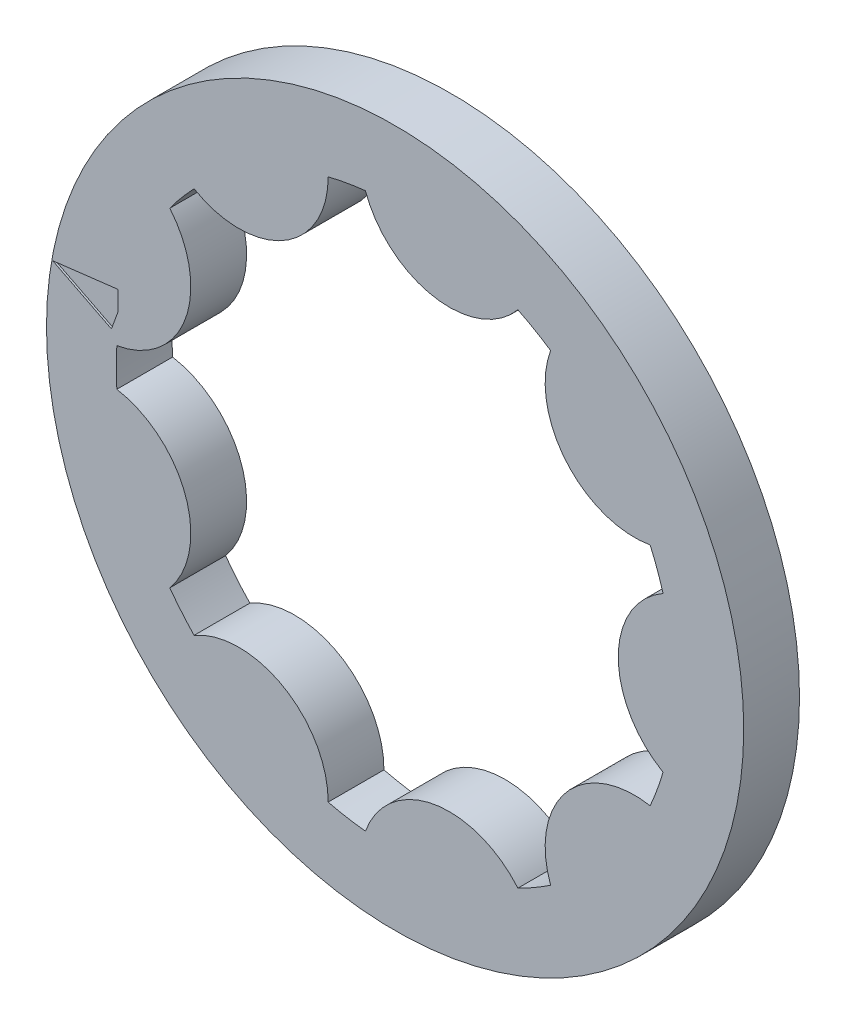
ISO-10303-21;
HEADER;
FILE_DESCRIPTION(('STEP AP214'),'2;1');
FILE_NAME('part.step','',(''),(''),'','','');
FILE_SCHEMA(('AUTOMOTIVE_DESIGN { 1 0 10303 214 1 1 1 1 }'));
ENDSEC;
DATA;
#1=APPLICATION_CONTEXT('core data for automotive mechanical design processes');
#2=APPLICATION_PROTOCOL_DEFINITION('international standard','automotive_design',2000,#1);
#3=PRODUCT_CONTEXT('',#1,'mechanical');
#4=PRODUCT('Part','Part','',(#3));
#5=PRODUCT_RELATED_PRODUCT_CATEGORY('part','',(#4));
#6=PRODUCT_DEFINITION_FORMATION('','',#4);
#7=PRODUCT_DEFINITION_CONTEXT('part definition',#1,'design');
#8=PRODUCT_DEFINITION('design','',#6,#7);
#9=PRODUCT_DEFINITION_SHAPE('','',#8);
#10=(LENGTH_UNIT() NAMED_UNIT(*) SI_UNIT(.MILLI.,.METRE.));
#11=(NAMED_UNIT(*) PLANE_ANGLE_UNIT() SI_UNIT($,.RADIAN.));
#12=(NAMED_UNIT(*) SI_UNIT($,.STERADIAN.) SOLID_ANGLE_UNIT());
#13=UNCERTAINTY_MEASURE_WITH_UNIT(LENGTH_MEASURE(1.E-05),#10,'distance_accuracy_value','');
#14=(GEOMETRIC_REPRESENTATION_CONTEXT(3) GLOBAL_UNCERTAINTY_ASSIGNED_CONTEXT((#13)) GLOBAL_UNIT_ASSIGNED_CONTEXT((#10,
#11,#12)) REPRESENTATION_CONTEXT('',''));
#15=CARTESIAN_POINT('',(0.,0.,0.));
#16=DIRECTION('',(0.,0.,1.));
#17=DIRECTION('',(1.,0.,0.));
#18=AXIS2_PLACEMENT_3D('',#15,#16,#17);
#19=CARTESIAN_POINT('',(0.,0.,3.));
#20=DIRECTION('',(0.,0.,1.));
#21=DIRECTION('',(1.,0.,0.));
#22=AXIS2_PLACEMENT_3D('',#19,#20,#21);
#23=PLANE('',#22);
#24=DIRECTION('',(0.892243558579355,-0.45155446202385,0.));
#25=VECTOR('',#24,1.);
#26=CARTESIAN_POINT('',(-18.4125710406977,3.24663305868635,3.));
#27=LINE('',#26,#25);
#28=CARTESIAN_POINT('',(-18.4125710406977,3.24663305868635,3.));
#29=VERTEX_POINT('',#28);
#30=CARTESIAN_POINT('',(-15.2568718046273,1.6495690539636,3.));
#31=VERTEX_POINT('',#30);
#32=EDGE_CURVE('E47',#29,#31,#27,.T.);
#33=ORIENTED_EDGE('',*,*,#32,.F.);
#34=DIRECTION('',(-0.992875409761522,-0.119157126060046,0.));
#35=VECTOR('',#34,1.);
#36=CARTESIAN_POINT('',(-18.4125710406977,3.24663305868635,3.));
#37=LINE('',#36,#35);
#38=CARTESIAN_POINT('',(-14.9009556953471,3.66806961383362,3.));
#39=VERTEX_POINT('',#38);
#40=EDGE_CURVE('E202',#39,#29,#37,.T.);
#41=ORIENTED_EDGE('',*,*,#40,.F.);
#42=DIRECTION('',(0.,1.,0.));
#43=VECTOR('',#42,1.);
#44=CARTESIAN_POINT('',(-14.9009556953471,3.66806961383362,3.));
#45=LINE('',#44,#43);
#46=CARTESIAN_POINT('',(-14.9009556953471,2.62744052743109,3.));
#47=VERTEX_POINT('',#46);
#48=EDGE_CURVE('E185',#47,#39,#45,.T.);
#49=ORIENTED_EDGE('',*,*,#48,.F.);
#50=DIRECTION('',(0.342020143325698,0.939692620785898,0.));
#51=VECTOR('',#50,1.);
#52=CARTESIAN_POINT('',(-15.2568718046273,1.6495690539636,3.));
#53=LINE('',#52,#51);
#54=EDGE_CURVE('E196',#31,#47,#53,.T.);
#55=ORIENTED_EDGE('',*,*,#54,.F.);
#56=EDGE_LOOP('',(#33,#41,#49,#55));
#57=FACE_BOUND('',#56,.T.);
#58=CARTESIAN_POINT('',(0.,0.,3.));
#59=DIRECTION('',(0.,0.,1.));
#60=DIRECTION('',(1.,0.,0.));
#61=AXIS2_PLACEMENT_3D('',#58,#59,#60);
#62=CIRCLE('',#61,18.75);
#63=CARTESIAN_POINT('',(18.75,0.,3.));
#64=VERTEX_POINT('',#63);
#65=EDGE_CURVE('E11',#64,#64,#62,.T.);
#66=ORIENTED_EDGE('',*,*,#65,.T.);
#67=EDGE_LOOP('',(#66));
#68=FACE_BOUND('',#67,.T.);
#69=CARTESIAN_POINT('',(2.9172893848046,16.5447702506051,3.));
#70=DIRECTION('',(0.,0.,-1.));
#71=DIRECTION('',(1.,0.,0.));
#72=AXIS2_PLACEMENT_3D('',#69,#70,#71);
#73=CIRCLE('',#72,4.8);
#74=CARTESIAN_POINT('',(6.6022370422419,13.4688702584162,3.));
#75=VERTEX_POINT('',#74);
#76=CARTESIAN_POINT('',(-1.59744849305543,14.9146960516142,3.));
#77=VERTEX_POINT('',#76);
#78=EDGE_CURVE('E278',#75,#77,#73,.T.);
#79=ORIENTED_EDGE('',*,*,#78,.F.);
#80=CARTESIAN_POINT('',(0.,0.,3.));
#81=DIRECTION('',(0.,0.,1.));
#82=DIRECTION('',(1.,0.,0.));
#83=AXIS2_PLACEMENT_3D('',#80,#81,#82);
#84=CIRCLE('',#83,15.);
#85=CARTESIAN_POINT('',(8.36326528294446,12.452140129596,3.));
#86=VERTEX_POINT('',#85);
#87=EDGE_CURVE('E276',#86,#75,#84,.T.);
#88=ORIENTED_EDGE('',*,*,#87,.F.);
#89=CARTESIAN_POINT('',(12.869546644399,10.7988318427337,3.));
#90=DIRECTION('',(0.,0.,-1.));
#91=DIRECTION('',(1.,0.,0.));
#92=AXIS2_PLACEMENT_3D('',#89,#90,#91);
#93=CIRCLE('',#92,4.8);
#94=CARTESIAN_POINT('',(13.7152299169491,6.07391704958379,3.));
#95=VERTEX_POINT('',#94);
#96=EDGE_CURVE('E274',#95,#86,#93,.T.);
#97=ORIENTED_EDGE('',*,*,#96,.F.);
#98=CARTESIAN_POINT('',(0.,0.,3.));
#99=DIRECTION('',(0.,0.,1.));
#100=DIRECTION('',(1.,0.,0.));
#101=AXIS2_PLACEMENT_3D('',#98,#99,#100);
#102=CIRCLE('',#101,15.);
#103=CARTESIAN_POINT('',(14.4107142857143,4.16308945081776,3.));
#104=VERTEX_POINT('',#103);
#105=EDGE_CURVE('E308',#104,#95,#102,.T.);
#106=ORIENTED_EDGE('',*,*,#105,.F.);
#107=CARTESIAN_POINT('',(16.8,0.,3.));
#108=DIRECTION('',(0.,0.,-1.));
#109=DIRECTION('',(1.,0.,0.));
#110=AXIS2_PLACEMENT_3D('',#107,#108,#109);
#111=CIRCLE('',#110,4.80000000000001);
#112=CARTESIAN_POINT('',(14.4107142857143,-4.16308945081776,3.));
#113=VERTEX_POINT('',#112);
#114=EDGE_CURVE('E306',#113,#104,#111,.T.);
#115=ORIENTED_EDGE('',*,*,#114,.F.);
#116=CARTESIAN_POINT('',(0.,0.,3.));
#117=DIRECTION('',(0.,0.,1.));
#118=DIRECTION('',(1.,0.,0.));
#119=AXIS2_PLACEMENT_3D('',#116,#117,#118);
#120=CIRCLE('',#119,15.);
#121=CARTESIAN_POINT('',(13.7152299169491,-6.07391704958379,3.));
#122=VERTEX_POINT('',#121);
#123=EDGE_CURVE('E304',#122,#113,#120,.T.);
#124=ORIENTED_EDGE('',*,*,#123,.F.);
#125=CARTESIAN_POINT('',(12.8695466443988,-10.7988318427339,3.));
#126=DIRECTION('',(0.,0.,-1.));
#127=DIRECTION('',(1.,0.,0.));
#128=AXIS2_PLACEMENT_3D('',#125,#126,#127);
#129=CIRCLE('',#128,4.8);
#130=CARTESIAN_POINT('',(8.36326528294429,-12.4521401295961,3.));
#131=VERTEX_POINT('',#130);
#132=EDGE_CURVE('E302',#131,#122,#129,.T.);
#133=ORIENTED_EDGE('',*,*,#132,.F.);
#134=CARTESIAN_POINT('',(0.,0.,3.));
#135=DIRECTION('',(0.,0.,1.));
#136=DIRECTION('',(1.,0.,0.));
#137=AXIS2_PLACEMENT_3D('',#134,#135,#136);
#138=CIRCLE('',#137,15.);
#139=CARTESIAN_POINT('',(6.60223704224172,-13.4688702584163,3.));
#140=VERTEX_POINT('',#139);
#141=EDGE_CURVE('E300',#140,#131,#138,.T.);
#142=ORIENTED_EDGE('',*,*,#141,.F.);
#143=CARTESIAN_POINT('',(2.91728938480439,-16.5447702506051,3.));
#144=DIRECTION('',(0.,0.,-1.));
#145=DIRECTION('',(1.,0.,0.));
#146=AXIS2_PLACEMENT_3D('',#143,#144,#145);
#147=CIRCLE('',#146,4.8);
#148=CARTESIAN_POINT('',(-1.59744849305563,-14.9146960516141,3.));
#149=VERTEX_POINT('',#148);
#150=EDGE_CURVE('E298',#149,#140,#147,.T.);
#151=ORIENTED_EDGE('',*,*,#150,.F.);
#152=CARTESIAN_POINT('',(0.,0.,3.));
#153=DIRECTION('',(0.,0.,1.));
#154=DIRECTION('',(1.,0.,0.));
#155=AXIS2_PLACEMENT_3D('',#152,#153,#154);
#156=CIRCLE('',#155,15.);
#157=CARTESIAN_POINT('',(-3.60001592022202,-14.5615893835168,3.));
#158=VERTEX_POINT('',#157);
#159=EDGE_CURVE('E296',#158,#149,#156,.T.);
#160=ORIENTED_EDGE('',*,*,#159,.F.);
#161=CARTESIAN_POINT('',(-8.40000000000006,-14.5492267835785,3.));
#162=DIRECTION('',(0.,0.,-1.));
#163=DIRECTION('',(1.,0.,0.));
#164=AXIS2_PLACEMENT_3D('',#161,#162,#163);
#165=CIRCLE('',#164,4.8);
#166=CARTESIAN_POINT('',(-10.8106983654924,-10.398499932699,3.));
#167=VERTEX_POINT('',#166);
#168=EDGE_CURVE('E294',#167,#158,#165,.T.);
#169=ORIENTED_EDGE('',*,*,#168,.F.);
#170=CARTESIAN_POINT('',(0.,0.,3.));
#171=DIRECTION('',(0.,0.,1.));
#172=DIRECTION('',(1.,0.,0.));
#173=AXIS2_PLACEMENT_3D('',#170,#171,#172);
#174=CIRCLE('',#173,15.);
#175=CARTESIAN_POINT('',(-12.1177814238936,-8.8407790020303,3.));
#176=VERTEX_POINT('',#175);
#177=EDGE_CURVE('E292',#176,#167,#174,.T.);
#178=ORIENTED_EDGE('',*,*,#177,.F.);
#179=CARTESIAN_POINT('',(-15.7868360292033,-5.74593840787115,3.));
#180=DIRECTION('',(0.,0.,-1.));
#181=DIRECTION('',(1.,0.,0.));
#182=AXIS2_PLACEMENT_3D('',#179,#180,#181);
#183=CIRCLE('',#182,4.8);
#184=CARTESIAN_POINT('',(-14.9655023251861,-1.01673012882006,3.));
#185=VERTEX_POINT('',#184);
#186=EDGE_CURVE('E290',#185,#176,#183,.T.);
#187=ORIENTED_EDGE('',*,*,#186,.F.);
#188=CARTESIAN_POINT('',(0.,0.,3.));
#189=DIRECTION('',(0.,0.,1.));
#190=DIRECTION('',(1.,0.,0.));
#191=AXIS2_PLACEMENT_3D('',#188,#189,#190);
#192=CIRCLE('',#191,15.);
#193=CARTESIAN_POINT('',(-14.9655023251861,1.01673012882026,3.));
#194=VERTEX_POINT('',#193);
#195=EDGE_CURVE('E288',#194,#185,#192,.T.);
#196=ORIENTED_EDGE('',*,*,#195,.F.);
#197=CARTESIAN_POINT('',(-15.7868360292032,5.74593840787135,3.));
#198=DIRECTION('',(0.,0.,-1.));
#199=DIRECTION('',(1.,0.,0.));
#200=AXIS2_PLACEMENT_3D('',#197,#198,#199);
#201=CIRCLE('',#200,4.8);
#202=CARTESIAN_POINT('',(-12.1177814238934,8.84077900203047,3.));
#203=VERTEX_POINT('',#202);
#204=EDGE_CURVE('E286',#203,#194,#201,.T.);
#205=ORIENTED_EDGE('',*,*,#204,.F.);
#206=CARTESIAN_POINT('',(0.,0.,3.));
#207=DIRECTION('',(0.,0.,1.));
#208=DIRECTION('',(1.,0.,0.));
#209=AXIS2_PLACEMENT_3D('',#206,#207,#208);
#210=CIRCLE('',#209,15.);
#211=CARTESIAN_POINT('',(-10.8106983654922,10.3984999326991,3.));
#212=VERTEX_POINT('',#211);
#213=EDGE_CURVE('E284',#212,#203,#210,.T.);
#214=ORIENTED_EDGE('',*,*,#213,.F.);
#215=CARTESIAN_POINT('',(-8.39999999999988,14.5492267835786,3.));
#216=DIRECTION('',(0.,0.,-1.));
#217=DIRECTION('',(1.,0.,0.));
#218=AXIS2_PLACEMENT_3D('',#215,#216,#217);
#219=CIRCLE('',#218,4.8);
#220=CARTESIAN_POINT('',(-3.60001592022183,14.5615893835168,3.));
#221=VERTEX_POINT('',#220);
#222=EDGE_CURVE('E282',#221,#212,#219,.T.);
#223=ORIENTED_EDGE('',*,*,#222,.F.);
#224=CARTESIAN_POINT('',(0.,0.,3.));
#225=DIRECTION('',(0.,0.,1.));
#226=DIRECTION('',(1.,0.,0.));
#227=AXIS2_PLACEMENT_3D('',#224,#225,#226);
#228=CIRCLE('',#227,15.);
#229=EDGE_CURVE('E280',#77,#221,#228,.T.);
#230=ORIENTED_EDGE('',*,*,#229,.F.);
#231=EDGE_LOOP('',(#79,#88,#97,#106,#115,#124,#133,#142,#151,#160,#169,#178,#187,#196,#205,#214,
#223,#230));
#232=FACE_BOUND('',#231,.T.);
#233=ADVANCED_FACE('F32',(#57,#68,#232),#23,.T.);
#234=CARTESIAN_POINT('',(0.,0.,0.));
#235=DIRECTION('',(0.,0.,1.));
#236=DIRECTION('',(1.,0.,0.));
#237=AXIS2_PLACEMENT_3D('',#234,#235,#236);
#238=PLANE('',#237);
#239=CARTESIAN_POINT('',(0.,0.,0.));
#240=DIRECTION('',(0.,0.,1.));
#241=DIRECTION('',(1.,0.,0.));
#242=AXIS2_PLACEMENT_3D('',#239,#240,#241);
#243=CIRCLE('',#242,18.75);
#244=CARTESIAN_POINT('',(18.75,0.,0.));
#245=VERTEX_POINT('',#244);
#246=EDGE_CURVE('E40',#245,#245,#243,.T.);
#247=ORIENTED_EDGE('',*,*,#246,.F.);
#248=EDGE_LOOP('',(#247));
#249=FACE_BOUND('',#248,.T.);
#250=CARTESIAN_POINT('',(0.,0.,0.));
#251=DIRECTION('',(0.,0.,1.));
#252=DIRECTION('',(1.,0.,0.));
#253=AXIS2_PLACEMENT_3D('',#250,#251,#252);
#254=CIRCLE('',#253,15.);
#255=CARTESIAN_POINT('',(8.36326528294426,12.4521401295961,0.));
#256=VERTEX_POINT('',#255);
#257=CARTESIAN_POINT('',(6.6022370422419,13.4688702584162,0.));
#258=VERTEX_POINT('',#257);
#259=EDGE_CURVE('E218',#256,#258,#254,.T.);
#260=ORIENTED_EDGE('',*,*,#259,.T.);
#261=CARTESIAN_POINT('',(2.9172893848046,16.5447702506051,0.));
#262=DIRECTION('',(0.,0.,-1.));
#263=DIRECTION('',(1.,0.,0.));
#264=AXIS2_PLACEMENT_3D('',#261,#262,#263);
#265=CIRCLE('',#264,4.8);
#266=CARTESIAN_POINT('',(-1.59744849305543,14.9146960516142,0.));
#267=VERTEX_POINT('',#266);
#268=EDGE_CURVE('E223',#258,#267,#265,.T.);
#269=ORIENTED_EDGE('',*,*,#268,.T.);
#270=CARTESIAN_POINT('',(0.,0.,0.));
#271=DIRECTION('',(0.,0.,1.));
#272=DIRECTION('',(1.,0.,0.));
#273=AXIS2_PLACEMENT_3D('',#270,#271,#272);
#274=CIRCLE('',#273,15.);
#275=CARTESIAN_POINT('',(-3.60001592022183,14.5615893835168,0.));
#276=VERTEX_POINT('',#275);
#277=EDGE_CURVE('E226',#267,#276,#274,.T.);
#278=ORIENTED_EDGE('',*,*,#277,.T.);
#279=CARTESIAN_POINT('',(-8.39999999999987,14.5492267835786,0.));
#280=DIRECTION('',(0.,0.,-1.));
#281=DIRECTION('',(1.,0.,0.));
#282=AXIS2_PLACEMENT_3D('',#279,#280,#281);
#283=CIRCLE('',#282,4.8);
#284=CARTESIAN_POINT('',(-10.8106983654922,10.3984999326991,0.));
#285=VERTEX_POINT('',#284);
#286=EDGE_CURVE('E229',#276,#285,#283,.T.);
#287=ORIENTED_EDGE('',*,*,#286,.T.);
#288=CARTESIAN_POINT('',(0.,0.,0.));
#289=DIRECTION('',(0.,0.,1.));
#290=DIRECTION('',(1.,0.,0.));
#291=AXIS2_PLACEMENT_3D('',#288,#289,#290);
#292=CIRCLE('',#291,15.);
#293=CARTESIAN_POINT('',(-12.1177814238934,8.84077900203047,0.));
#294=VERTEX_POINT('',#293);
#295=EDGE_CURVE('E232',#285,#294,#292,.T.);
#296=ORIENTED_EDGE('',*,*,#295,.T.);
#297=CARTESIAN_POINT('',(-15.7868360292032,5.74593840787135,0.));
#298=DIRECTION('',(0.,0.,-1.));
#299=DIRECTION('',(1.,0.,0.));
#300=AXIS2_PLACEMENT_3D('',#297,#298,#299);
#301=CIRCLE('',#300,4.8);
#302=CARTESIAN_POINT('',(-14.9655023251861,1.01673012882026,0.));
#303=VERTEX_POINT('',#302);
#304=EDGE_CURVE('E235',#294,#303,#301,.T.);
#305=ORIENTED_EDGE('',*,*,#304,.T.);
#306=CARTESIAN_POINT('',(0.,0.,0.));
#307=DIRECTION('',(0.,0.,1.));
#308=DIRECTION('',(1.,0.,0.));
#309=AXIS2_PLACEMENT_3D('',#306,#307,#308);
#310=CIRCLE('',#309,15.);
#311=CARTESIAN_POINT('',(-14.9655023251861,-1.01673012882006,0.));
#312=VERTEX_POINT('',#311);
#313=EDGE_CURVE('E238',#303,#312,#310,.T.);
#314=ORIENTED_EDGE('',*,*,#313,.T.);
#315=CARTESIAN_POINT('',(-15.7868360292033,-5.74593840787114,0.));
#316=DIRECTION('',(0.,0.,-1.));
#317=DIRECTION('',(1.,0.,0.));
#318=AXIS2_PLACEMENT_3D('',#315,#316,#317);
#319=CIRCLE('',#318,4.8);
#320=CARTESIAN_POINT('',(-12.1177814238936,-8.8407790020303,0.));
#321=VERTEX_POINT('',#320);
#322=EDGE_CURVE('E241',#312,#321,#319,.T.);
#323=ORIENTED_EDGE('',*,*,#322,.T.);
#324=CARTESIAN_POINT('',(0.,0.,0.));
#325=DIRECTION('',(0.,0.,1.));
#326=DIRECTION('',(1.,0.,0.));
#327=AXIS2_PLACEMENT_3D('',#324,#325,#326);
#328=CIRCLE('',#327,15.);
#329=CARTESIAN_POINT('',(-10.8106983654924,-10.398499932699,0.));
#330=VERTEX_POINT('',#329);
#331=EDGE_CURVE('E244',#321,#330,#328,.T.);
#332=ORIENTED_EDGE('',*,*,#331,.T.);
#333=CARTESIAN_POINT('',(-8.40000000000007,-14.5492267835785,0.));
#334=DIRECTION('',(0.,0.,-1.));
#335=DIRECTION('',(1.,0.,0.));
#336=AXIS2_PLACEMENT_3D('',#333,#334,#335);
#337=CIRCLE('',#336,4.8);
#338=CARTESIAN_POINT('',(-3.60001592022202,-14.5615893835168,0.));
#339=VERTEX_POINT('',#338);
#340=EDGE_CURVE('E247',#330,#339,#337,.T.);
#341=ORIENTED_EDGE('',*,*,#340,.T.);
#342=CARTESIAN_POINT('',(0.,0.,0.));
#343=DIRECTION('',(0.,0.,1.));
#344=DIRECTION('',(1.,0.,0.));
#345=AXIS2_PLACEMENT_3D('',#342,#343,#344);
#346=CIRCLE('',#345,15.);
#347=CARTESIAN_POINT('',(-1.59744849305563,-14.9146960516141,0.));
#348=VERTEX_POINT('',#347);
#349=EDGE_CURVE('E250',#339,#348,#346,.T.);
#350=ORIENTED_EDGE('',*,*,#349,.T.);
#351=CARTESIAN_POINT('',(2.91728938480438,-16.5447702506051,0.));
#352=DIRECTION('',(0.,0.,-1.));
#353=DIRECTION('',(1.,0.,0.));
#354=AXIS2_PLACEMENT_3D('',#351,#352,#353);
#355=CIRCLE('',#354,4.8);
#356=CARTESIAN_POINT('',(6.60223704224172,-13.4688702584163,0.));
#357=VERTEX_POINT('',#356);
#358=EDGE_CURVE('E253',#348,#357,#355,.T.);
#359=ORIENTED_EDGE('',*,*,#358,.T.);
#360=CARTESIAN_POINT('',(0.,0.,0.));
#361=DIRECTION('',(0.,0.,1.));
#362=DIRECTION('',(1.,0.,0.));
#363=AXIS2_PLACEMENT_3D('',#360,#361,#362);
#364=CIRCLE('',#363,15.);
#365=CARTESIAN_POINT('',(8.36326528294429,-12.4521401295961,0.));
#366=VERTEX_POINT('',#365);
#367=EDGE_CURVE('E256',#357,#366,#364,.T.);
#368=ORIENTED_EDGE('',*,*,#367,.T.);
#369=CARTESIAN_POINT('',(12.8695466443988,-10.7988318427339,0.));
#370=DIRECTION('',(0.,0.,-1.));
#371=DIRECTION('',(1.,0.,0.));
#372=AXIS2_PLACEMENT_3D('',#369,#370,#371);
#373=CIRCLE('',#372,4.8);
#374=CARTESIAN_POINT('',(13.7152299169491,-6.07391704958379,0.));
#375=VERTEX_POINT('',#374);
#376=EDGE_CURVE('E259',#366,#375,#373,.T.);
#377=ORIENTED_EDGE('',*,*,#376,.T.);
#378=CARTESIAN_POINT('',(0.,0.,0.));
#379=DIRECTION('',(0.,0.,1.));
#380=DIRECTION('',(1.,0.,0.));
#381=AXIS2_PLACEMENT_3D('',#378,#379,#380);
#382=CIRCLE('',#381,15.);
#383=CARTESIAN_POINT('',(14.4107142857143,-4.16308945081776,0.));
#384=VERTEX_POINT('',#383);
#385=EDGE_CURVE('E262',#375,#384,#382,.T.);
#386=ORIENTED_EDGE('',*,*,#385,.T.);
#387=CARTESIAN_POINT('',(16.8,0.,0.));
#388=DIRECTION('',(0.,0.,-1.));
#389=DIRECTION('',(1.,0.,0.));
#390=AXIS2_PLACEMENT_3D('',#387,#388,#389);
#391=CIRCLE('',#390,4.8);
#392=CARTESIAN_POINT('',(14.4107142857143,4.16308945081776,0.));
#393=VERTEX_POINT('',#392);
#394=EDGE_CURVE('E265',#384,#393,#391,.T.);
#395=ORIENTED_EDGE('',*,*,#394,.T.);
#396=CARTESIAN_POINT('',(0.,0.,0.));
#397=DIRECTION('',(0.,0.,1.));
#398=DIRECTION('',(1.,0.,0.));
#399=AXIS2_PLACEMENT_3D('',#396,#397,#398);
#400=CIRCLE('',#399,15.);
#401=CARTESIAN_POINT('',(13.7152299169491,6.07391704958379,0.));
#402=VERTEX_POINT('',#401);
#403=EDGE_CURVE('E268',#393,#402,#400,.T.);
#404=ORIENTED_EDGE('',*,*,#403,.T.);
#405=CARTESIAN_POINT('',(12.8695466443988,10.7988318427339,0.));
#406=DIRECTION('',(0.,0.,-1.));
#407=DIRECTION('',(1.,0.,0.));
#408=AXIS2_PLACEMENT_3D('',#405,#406,#407);
#409=CIRCLE('',#408,4.8);
#410=EDGE_CURVE('E271',#402,#256,#409,.T.);
#411=ORIENTED_EDGE('',*,*,#410,.T.);
#412=EDGE_LOOP('',(#260,#269,#278,#287,#296,#305,#314,#323,#332,#341,#350,#359,#368,#377,#386,
#395,#404,#411));
#413=FACE_BOUND('',#412,.T.);
#414=ADVANCED_FACE('F356',(#249,#413),#238,.F.);
#415=CARTESIAN_POINT('',(0.,0.,3.));
#416=DIRECTION('',(0.,0.,-1.));
#417=DIRECTION('',(-1.,0.,0.));
#418=AXIS2_PLACEMENT_3D('',#415,#416,#417);
#419=CYLINDRICAL_SURFACE('',#418,18.75);
#420=ORIENTED_EDGE('',*,*,#65,.F.);
#421=EDGE_LOOP('',(#420));
#422=FACE_BOUND('',#421,.T.);
#423=ORIENTED_EDGE('',*,*,#246,.T.);
#424=EDGE_LOOP('',(#423));
#425=FACE_BOUND('',#424,.T.);
#426=ADVANCED_FACE('F34',(#422,#425),#419,.T.);
#427=CARTESIAN_POINT('',(0.,0.,3.));
#428=DIRECTION('',(0.,0.,-1.));
#429=DIRECTION('',(-1.,0.,0.));
#430=AXIS2_PLACEMENT_3D('',#427,#428,#429);
#431=CYLINDRICAL_SURFACE('',#430,15.);
#432=ORIENTED_EDGE('',*,*,#259,.F.);
#433=DIRECTION('',(0.,0.,-1.));
#434=VECTOR('',#433,1.);
#435=CARTESIAN_POINT('',(8.36326528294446,12.452140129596,3.));
#436=LINE('',#435,#434);
#437=EDGE_CURVE('E351',#86,#256,#436,.T.);
#438=ORIENTED_EDGE('',*,*,#437,.F.);
#439=ORIENTED_EDGE('',*,*,#87,.T.);
#440=DIRECTION('',(0.,0.,-1.));
#441=VECTOR('',#440,1.);
#442=CARTESIAN_POINT('',(6.6022370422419,13.4688702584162,3.));
#443=LINE('',#442,#441);
#444=EDGE_CURVE('E348',#75,#258,#443,.T.);
#445=ORIENTED_EDGE('',*,*,#444,.T.);
#446=EDGE_LOOP('',(#432,#438,#439,#445));
#447=FACE_BOUND('',#446,.T.);
#448=ADVANCED_FACE('F363',(#447),#431,.F.);
#449=CARTESIAN_POINT('',(2.9172893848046,16.5447702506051,3.));
#450=DIRECTION('',(0.,0.,-1.));
#451=DIRECTION('',(-1.,0.,0.));
#452=AXIS2_PLACEMENT_3D('',#449,#450,#451);
#453=CYLINDRICAL_SURFACE('',#452,4.8);
#454=ORIENTED_EDGE('',*,*,#268,.F.);
#455=ORIENTED_EDGE('',*,*,#444,.F.);
#456=ORIENTED_EDGE('',*,*,#78,.T.);
#457=DIRECTION('',(0.,0.,-1.));
#458=VECTOR('',#457,1.);
#459=CARTESIAN_POINT('',(-1.59744849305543,14.9146960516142,3.));
#460=LINE('',#459,#458);
#461=EDGE_CURVE('E346',#77,#267,#460,.T.);
#462=ORIENTED_EDGE('',*,*,#461,.T.);
#463=EDGE_LOOP('',(#454,#455,#456,#462));
#464=FACE_BOUND('',#463,.T.);
#465=ADVANCED_FACE('F368',(#464),#453,.T.);
#466=CARTESIAN_POINT('',(0.,0.,3.));
#467=DIRECTION('',(0.,0.,-1.));
#468=DIRECTION('',(-1.,0.,0.));
#469=AXIS2_PLACEMENT_3D('',#466,#467,#468);
#470=CYLINDRICAL_SURFACE('',#469,15.);
#471=ORIENTED_EDGE('',*,*,#277,.F.);
#472=ORIENTED_EDGE('',*,*,#461,.F.);
#473=ORIENTED_EDGE('',*,*,#229,.T.);
#474=DIRECTION('',(0.,0.,-1.));
#475=VECTOR('',#474,1.);
#476=CARTESIAN_POINT('',(-3.60001592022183,14.5615893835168,3.));
#477=LINE('',#476,#475);
#478=EDGE_CURVE('E343',#221,#276,#477,.T.);
#479=ORIENTED_EDGE('',*,*,#478,.T.);
#480=EDGE_LOOP('',(#471,#472,#473,#479));
#481=FACE_BOUND('',#480,.T.);
#482=ADVANCED_FACE('F378',(#481),#470,.F.);
#483=CARTESIAN_POINT('',(-8.39999999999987,14.5492267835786,3.));
#484=DIRECTION('',(0.,0.,-1.));
#485=DIRECTION('',(-1.,0.,0.));
#486=AXIS2_PLACEMENT_3D('',#483,#484,#485);
#487=CYLINDRICAL_SURFACE('',#486,4.8);
#488=ORIENTED_EDGE('',*,*,#286,.F.);
#489=ORIENTED_EDGE('',*,*,#478,.F.);
#490=ORIENTED_EDGE('',*,*,#222,.T.);
#491=DIRECTION('',(0.,0.,-1.));
#492=VECTOR('',#491,1.);
#493=CARTESIAN_POINT('',(-10.8106983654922,10.3984999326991,3.));
#494=LINE('',#493,#492);
#495=EDGE_CURVE('E341',#212,#285,#494,.T.);
#496=ORIENTED_EDGE('',*,*,#495,.T.);
#497=EDGE_LOOP('',(#488,#489,#490,#496));
#498=FACE_BOUND('',#497,.T.);
#499=ADVANCED_FACE('F380',(#498),#487,.T.);
#500=CARTESIAN_POINT('',(0.,0.,3.));
#501=DIRECTION('',(0.,0.,-1.));
#502=DIRECTION('',(-1.,0.,0.));
#503=AXIS2_PLACEMENT_3D('',#500,#501,#502);
#504=CYLINDRICAL_SURFACE('',#503,15.);
#505=ORIENTED_EDGE('',*,*,#295,.F.);
#506=ORIENTED_EDGE('',*,*,#495,.F.);
#507=ORIENTED_EDGE('',*,*,#213,.T.);
#508=DIRECTION('',(0.,0.,-1.));
#509=VECTOR('',#508,1.);
#510=CARTESIAN_POINT('',(-12.1177814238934,8.84077900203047,3.));
#511=LINE('',#510,#509);
#512=EDGE_CURVE('E338',#203,#294,#511,.T.);
#513=ORIENTED_EDGE('',*,*,#512,.T.);
#514=EDGE_LOOP('',(#505,#506,#507,#513));
#515=FACE_BOUND('',#514,.T.);
#516=ADVANCED_FACE('F384',(#515),#504,.F.);
#517=CARTESIAN_POINT('',(-15.7868360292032,5.74593840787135,3.));
#518=DIRECTION('',(0.,0.,-1.));
#519=DIRECTION('',(-1.,0.,0.));
#520=AXIS2_PLACEMENT_3D('',#517,#518,#519);
#521=CYLINDRICAL_SURFACE('',#520,4.8);
#522=ORIENTED_EDGE('',*,*,#304,.F.);
#523=ORIENTED_EDGE('',*,*,#512,.F.);
#524=ORIENTED_EDGE('',*,*,#204,.T.);
#525=DIRECTION('',(0.,0.,-1.));
#526=VECTOR('',#525,1.);
#527=CARTESIAN_POINT('',(-14.9655023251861,1.01673012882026,3.));
#528=LINE('',#527,#526);
#529=EDGE_CURVE('E336',#194,#303,#528,.T.);
#530=ORIENTED_EDGE('',*,*,#529,.T.);
#531=EDGE_LOOP('',(#522,#523,#524,#530));
#532=FACE_BOUND('',#531,.T.);
#533=ADVANCED_FACE('F388',(#532),#521,.T.);
#534=CARTESIAN_POINT('',(0.,0.,3.));
#535=DIRECTION('',(0.,0.,-1.));
#536=DIRECTION('',(-1.,0.,0.));
#537=AXIS2_PLACEMENT_3D('',#534,#535,#536);
#538=CYLINDRICAL_SURFACE('',#537,15.);
#539=ORIENTED_EDGE('',*,*,#313,.F.);
#540=ORIENTED_EDGE('',*,*,#529,.F.);
#541=ORIENTED_EDGE('',*,*,#195,.T.);
#542=DIRECTION('',(0.,0.,-1.));
#543=VECTOR('',#542,1.);
#544=CARTESIAN_POINT('',(-14.9655023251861,-1.01673012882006,3.));
#545=LINE('',#544,#543);
#546=EDGE_CURVE('E333',#185,#312,#545,.T.);
#547=ORIENTED_EDGE('',*,*,#546,.T.);
#548=EDGE_LOOP('',(#539,#540,#541,#547));
#549=FACE_BOUND('',#548,.T.);
#550=ADVANCED_FACE('F396',(#549),#538,.F.);
#551=CARTESIAN_POINT('',(-15.7868360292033,-5.74593840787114,3.));
#552=DIRECTION('',(0.,0.,-1.));
#553=DIRECTION('',(-1.,0.,0.));
#554=AXIS2_PLACEMENT_3D('',#551,#552,#553);
#555=CYLINDRICAL_SURFACE('',#554,4.8);
#556=ORIENTED_EDGE('',*,*,#322,.F.);
#557=ORIENTED_EDGE('',*,*,#546,.F.);
#558=ORIENTED_EDGE('',*,*,#186,.T.);
#559=DIRECTION('',(0.,0.,-1.));
#560=VECTOR('',#559,1.);
#561=CARTESIAN_POINT('',(-12.1177814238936,-8.8407790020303,3.));
#562=LINE('',#561,#560);
#563=EDGE_CURVE('E331',#176,#321,#562,.T.);
#564=ORIENTED_EDGE('',*,*,#563,.T.);
#565=EDGE_LOOP('',(#556,#557,#558,#564));
#566=FACE_BOUND('',#565,.T.);
#567=ADVANCED_FACE('F398',(#566),#555,.T.);
#568=CARTESIAN_POINT('',(0.,0.,3.));
#569=DIRECTION('',(0.,0.,-1.));
#570=DIRECTION('',(-1.,0.,0.));
#571=AXIS2_PLACEMENT_3D('',#568,#569,#570);
#572=CYLINDRICAL_SURFACE('',#571,15.);
#573=ORIENTED_EDGE('',*,*,#331,.F.);
#574=ORIENTED_EDGE('',*,*,#563,.F.);
#575=ORIENTED_EDGE('',*,*,#177,.T.);
#576=DIRECTION('',(0.,0.,-1.));
#577=VECTOR('',#576,1.);
#578=CARTESIAN_POINT('',(-10.8106983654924,-10.398499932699,3.));
#579=LINE('',#578,#577);
#580=EDGE_CURVE('E328',#167,#330,#579,.T.);
#581=ORIENTED_EDGE('',*,*,#580,.T.);
#582=EDGE_LOOP('',(#573,#574,#575,#581));
#583=FACE_BOUND('',#582,.T.);
#584=ADVANCED_FACE('F402',(#583),#572,.F.);
#585=CARTESIAN_POINT('',(-8.40000000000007,-14.5492267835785,3.));
#586=DIRECTION('',(0.,0.,-1.));
#587=DIRECTION('',(-1.,0.,0.));
#588=AXIS2_PLACEMENT_3D('',#585,#586,#587);
#589=CYLINDRICAL_SURFACE('',#588,4.8);
#590=ORIENTED_EDGE('',*,*,#340,.F.);
#591=ORIENTED_EDGE('',*,*,#580,.F.);
#592=ORIENTED_EDGE('',*,*,#168,.T.);
#593=DIRECTION('',(0.,0.,-1.));
#594=VECTOR('',#593,1.);
#595=CARTESIAN_POINT('',(-3.60001592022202,-14.5615893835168,3.));
#596=LINE('',#595,#594);
#597=EDGE_CURVE('E326',#158,#339,#596,.T.);
#598=ORIENTED_EDGE('',*,*,#597,.T.);
#599=EDGE_LOOP('',(#590,#591,#592,#598));
#600=FACE_BOUND('',#599,.T.);
#601=ADVANCED_FACE('F406',(#600),#589,.T.);
#602=CARTESIAN_POINT('',(0.,0.,3.));
#603=DIRECTION('',(0.,0.,-1.));
#604=DIRECTION('',(-1.,0.,0.));
#605=AXIS2_PLACEMENT_3D('',#602,#603,#604);
#606=CYLINDRICAL_SURFACE('',#605,15.);
#607=ORIENTED_EDGE('',*,*,#349,.F.);
#608=ORIENTED_EDGE('',*,*,#597,.F.);
#609=ORIENTED_EDGE('',*,*,#159,.T.);
#610=DIRECTION('',(0.,0.,-1.));
#611=VECTOR('',#610,1.);
#612=CARTESIAN_POINT('',(-1.59744849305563,-14.9146960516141,3.));
#613=LINE('',#612,#611);
#614=EDGE_CURVE('E323',#149,#348,#613,.T.);
#615=ORIENTED_EDGE('',*,*,#614,.T.);
#616=EDGE_LOOP('',(#607,#608,#609,#615));
#617=FACE_BOUND('',#616,.T.);
#618=ADVANCED_FACE('F414',(#617),#606,.F.);
#619=CARTESIAN_POINT('',(2.91728938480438,-16.5447702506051,3.));
#620=DIRECTION('',(0.,0.,-1.));
#621=DIRECTION('',(-1.,0.,0.));
#622=AXIS2_PLACEMENT_3D('',#619,#620,#621);
#623=CYLINDRICAL_SURFACE('',#622,4.8);
#624=ORIENTED_EDGE('',*,*,#358,.F.);
#625=ORIENTED_EDGE('',*,*,#614,.F.);
#626=ORIENTED_EDGE('',*,*,#150,.T.);
#627=DIRECTION('',(0.,0.,-1.));
#628=VECTOR('',#627,1.);
#629=CARTESIAN_POINT('',(6.60223704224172,-13.4688702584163,3.));
#630=LINE('',#629,#628);
#631=EDGE_CURVE('E321',#140,#357,#630,.T.);
#632=ORIENTED_EDGE('',*,*,#631,.T.);
#633=EDGE_LOOP('',(#624,#625,#626,#632));
#634=FACE_BOUND('',#633,.T.);
#635=ADVANCED_FACE('F416',(#634),#623,.T.);
#636=CARTESIAN_POINT('',(0.,0.,3.));
#637=DIRECTION('',(0.,0.,-1.));
#638=DIRECTION('',(-1.,0.,0.));
#639=AXIS2_PLACEMENT_3D('',#636,#637,#638);
#640=CYLINDRICAL_SURFACE('',#639,15.);
#641=ORIENTED_EDGE('',*,*,#367,.F.);
#642=ORIENTED_EDGE('',*,*,#631,.F.);
#643=ORIENTED_EDGE('',*,*,#141,.T.);
#644=DIRECTION('',(0.,0.,-1.));
#645=VECTOR('',#644,1.);
#646=CARTESIAN_POINT('',(8.36326528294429,-12.4521401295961,3.));
#647=LINE('',#646,#645);
#648=EDGE_CURVE('E318',#131,#366,#647,.T.);
#649=ORIENTED_EDGE('',*,*,#648,.T.);
#650=EDGE_LOOP('',(#641,#642,#643,#649));
#651=FACE_BOUND('',#650,.T.);
#652=ADVANCED_FACE('F420',(#651),#640,.F.);
#653=CARTESIAN_POINT('',(12.8695466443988,-10.7988318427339,3.));
#654=DIRECTION('',(0.,0.,-1.));
#655=DIRECTION('',(-1.,0.,0.));
#656=AXIS2_PLACEMENT_3D('',#653,#654,#655);
#657=CYLINDRICAL_SURFACE('',#656,4.8);
#658=ORIENTED_EDGE('',*,*,#376,.F.);
#659=ORIENTED_EDGE('',*,*,#648,.F.);
#660=ORIENTED_EDGE('',*,*,#132,.T.);
#661=DIRECTION('',(0.,0.,-1.));
#662=VECTOR('',#661,1.);
#663=CARTESIAN_POINT('',(13.7152299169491,-6.07391704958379,3.));
#664=LINE('',#663,#662);
#665=EDGE_CURVE('E316',#122,#375,#664,.T.);
#666=ORIENTED_EDGE('',*,*,#665,.T.);
#667=EDGE_LOOP('',(#658,#659,#660,#666));
#668=FACE_BOUND('',#667,.T.);
#669=ADVANCED_FACE('F424',(#668),#657,.T.);
#670=CARTESIAN_POINT('',(0.,0.,3.));
#671=DIRECTION('',(0.,0.,-1.));
#672=DIRECTION('',(-1.,0.,0.));
#673=AXIS2_PLACEMENT_3D('',#670,#671,#672);
#674=CYLINDRICAL_SURFACE('',#673,15.);
#675=ORIENTED_EDGE('',*,*,#385,.F.);
#676=ORIENTED_EDGE('',*,*,#665,.F.);
#677=ORIENTED_EDGE('',*,*,#123,.T.);
#678=DIRECTION('',(0.,0.,-1.));
#679=VECTOR('',#678,1.);
#680=CARTESIAN_POINT('',(14.4107142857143,-4.16308945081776,3.));
#681=LINE('',#680,#679);
#682=EDGE_CURVE('E313',#113,#384,#681,.T.);
#683=ORIENTED_EDGE('',*,*,#682,.T.);
#684=EDGE_LOOP('',(#675,#676,#677,#683));
#685=FACE_BOUND('',#684,.T.);
#686=ADVANCED_FACE('F432',(#685),#674,.F.);
#687=CARTESIAN_POINT('',(16.8,0.,3.));
#688=DIRECTION('',(0.,0.,-1.));
#689=DIRECTION('',(-1.,0.,0.));
#690=AXIS2_PLACEMENT_3D('',#687,#688,#689);
#691=CYLINDRICAL_SURFACE('',#690,4.8);
#692=ORIENTED_EDGE('',*,*,#394,.F.);
#693=ORIENTED_EDGE('',*,*,#682,.F.);
#694=ORIENTED_EDGE('',*,*,#114,.T.);
#695=DIRECTION('',(0.,0.,-1.));
#696=VECTOR('',#695,1.);
#697=CARTESIAN_POINT('',(14.4107142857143,4.16308945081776,3.));
#698=LINE('',#697,#696);
#699=EDGE_CURVE('E311',#104,#393,#698,.T.);
#700=ORIENTED_EDGE('',*,*,#699,.T.);
#701=EDGE_LOOP('',(#692,#693,#694,#700));
#702=FACE_BOUND('',#701,.T.);
#703=ADVANCED_FACE('F434',(#702),#691,.T.);
#704=CARTESIAN_POINT('',(0.,0.,3.));
#705=DIRECTION('',(0.,0.,-1.));
#706=DIRECTION('',(-1.,0.,0.));
#707=AXIS2_PLACEMENT_3D('',#704,#705,#706);
#708=CYLINDRICAL_SURFACE('',#707,15.);
#709=ORIENTED_EDGE('',*,*,#403,.F.);
#710=ORIENTED_EDGE('',*,*,#699,.F.);
#711=ORIENTED_EDGE('',*,*,#105,.T.);
#712=DIRECTION('',(0.,0.,-1.));
#713=VECTOR('',#712,1.);
#714=CARTESIAN_POINT('',(13.7152299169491,6.07391704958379,3.));
#715=LINE('',#714,#713);
#716=EDGE_CURVE('E55',#95,#402,#715,.T.);
#717=ORIENTED_EDGE('',*,*,#716,.T.);
#718=EDGE_LOOP('',(#709,#710,#711,#717));
#719=FACE_BOUND('',#718,.T.);
#720=ADVANCED_FACE('F438',(#719),#708,.F.);
#721=CARTESIAN_POINT('',(12.8695466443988,10.7988318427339,3.));
#722=DIRECTION('',(0.,0.,-1.));
#723=DIRECTION('',(-1.,0.,0.));
#724=AXIS2_PLACEMENT_3D('',#721,#722,#723);
#725=CYLINDRICAL_SURFACE('',#724,4.8);
#726=ORIENTED_EDGE('',*,*,#410,.F.);
#727=ORIENTED_EDGE('',*,*,#716,.F.);
#728=ORIENTED_EDGE('',*,*,#96,.T.);
#729=ORIENTED_EDGE('',*,*,#437,.T.);
#730=EDGE_LOOP('',(#726,#727,#728,#729));
#731=FACE_BOUND('',#730,.T.);
#732=ADVANCED_FACE('F439',(#731),#725,.T.);
#733=CARTESIAN_POINT('',(-18.4125710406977,3.24663305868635,2.9));
#734=DIRECTION('',(-0.45155446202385,-0.892243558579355,0.));
#735=DIRECTION('',(0.892243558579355,-0.45155446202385,0.));
#736=AXIS2_PLACEMENT_3D('',#733,#734,#735);
#737=PLANE('',#736);
#738=ORIENTED_EDGE('',*,*,#32,.T.);
#739=DIRECTION('',(0.,0.,1.));
#740=VECTOR('',#739,1.);
#741=CARTESIAN_POINT('',(-15.2568718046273,1.6495690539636,2.9));
#742=LINE('',#741,#740);
#743=CARTESIAN_POINT('',(-15.2568718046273,1.6495690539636,2.9));
#744=VERTEX_POINT('',#743);
#745=EDGE_CURVE('E193',#744,#31,#742,.T.);
#746=ORIENTED_EDGE('',*,*,#745,.F.);
#747=DIRECTION('',(0.892243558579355,-0.45155446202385,0.));
#748=VECTOR('',#747,1.);
#749=CARTESIAN_POINT('',(-18.4125710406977,3.24663305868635,2.9));
#750=LINE('',#749,#748);
#751=CARTESIAN_POINT('',(-18.4125710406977,3.24663305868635,2.9));
#752=VERTEX_POINT('',#751);
#753=EDGE_CURVE('E204',#752,#744,#750,.T.);
#754=ORIENTED_EDGE('',*,*,#753,.F.);
#755=DIRECTION('',(0.,0.,1.));
#756=VECTOR('',#755,1.);
#757=CARTESIAN_POINT('',(-18.4125710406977,3.24663305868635,2.9));
#758=LINE('',#757,#756);
#759=EDGE_CURVE('E216',#752,#29,#758,.T.);
#760=ORIENTED_EDGE('',*,*,#759,.T.);
#761=EDGE_LOOP('',(#738,#746,#754,#760));
#762=FACE_BOUND('',#761,.T.);
#763=ADVANCED_FACE('F441',(#762),#737,.F.);
#764=CARTESIAN_POINT('',(-18.4125710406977,3.24663305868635,2.9));
#765=DIRECTION('',(-0.119157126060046,0.992875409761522,0.));
#766=DIRECTION('',(-0.992875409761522,-0.119157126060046,0.));
#767=AXIS2_PLACEMENT_3D('',#764,#765,#766);
#768=PLANE('',#767);
#769=ORIENTED_EDGE('',*,*,#40,.T.);
#770=ORIENTED_EDGE('',*,*,#759,.F.);
#771=DIRECTION('',(-0.992875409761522,-0.119157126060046,0.));
#772=VECTOR('',#771,1.);
#773=CARTESIAN_POINT('',(-18.4125710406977,3.24663305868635,2.9));
#774=LINE('',#773,#772);
#775=CARTESIAN_POINT('',(-14.9009556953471,3.66806961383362,2.9));
#776=VERTEX_POINT('',#775);
#777=EDGE_CURVE('E213',#776,#752,#774,.T.);
#778=ORIENTED_EDGE('',*,*,#777,.F.);
#779=DIRECTION('',(0.,0.,1.));
#780=VECTOR('',#779,1.);
#781=CARTESIAN_POINT('',(-14.9009556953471,3.66806961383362,2.9));
#782=LINE('',#781,#780);
#783=EDGE_CURVE('E192',#776,#39,#782,.T.);
#784=ORIENTED_EDGE('',*,*,#783,.T.);
#785=EDGE_LOOP('',(#769,#770,#778,#784));
#786=FACE_BOUND('',#785,.T.);
#787=ADVANCED_FACE('F447',(#786),#768,.F.);
#788=CARTESIAN_POINT('',(-14.9009556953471,3.66806961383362,2.9));
#789=DIRECTION('',(1.,0.,0.));
#790=DIRECTION('',(0.,1.,0.));
#791=AXIS2_PLACEMENT_3D('',#788,#789,#790);
#792=PLANE('',#791);
#793=ORIENTED_EDGE('',*,*,#48,.T.);
#794=ORIENTED_EDGE('',*,*,#783,.F.);
#795=DIRECTION('',(0.,1.,0.));
#796=VECTOR('',#795,1.);
#797=CARTESIAN_POINT('',(-14.9009556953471,3.66806961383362,2.9));
#798=LINE('',#797,#796);
#799=CARTESIAN_POINT('',(-14.9009556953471,2.62744052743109,2.9));
#800=VERTEX_POINT('',#799);
#801=EDGE_CURVE('E188',#800,#776,#798,.T.);
#802=ORIENTED_EDGE('',*,*,#801,.F.);
#803=DIRECTION('',(0.,0.,1.));
#804=VECTOR('',#803,1.);
#805=CARTESIAN_POINT('',(-14.9009556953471,2.62744052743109,2.9));
#806=LINE('',#805,#804);
#807=EDGE_CURVE('E181',#800,#47,#806,.T.);
#808=ORIENTED_EDGE('',*,*,#807,.T.);
#809=EDGE_LOOP('',(#793,#794,#802,#808));
#810=FACE_BOUND('',#809,.T.);
#811=ADVANCED_FACE('F183',(#810),#792,.F.);
#812=CARTESIAN_POINT('',(-15.2568718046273,1.6495690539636,2.9));
#813=DIRECTION('',(0.939692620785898,-0.342020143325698,0.));
#814=DIRECTION('',(0.342020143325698,0.939692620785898,0.));
#815=AXIS2_PLACEMENT_3D('',#812,#813,#814);
#816=PLANE('',#815);
#817=ORIENTED_EDGE('',*,*,#54,.T.);
#818=ORIENTED_EDGE('',*,*,#807,.F.);
#819=DIRECTION('',(0.342020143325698,0.939692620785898,0.));
#820=VECTOR('',#819,1.);
#821=CARTESIAN_POINT('',(-15.2568718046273,1.6495690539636,2.9));
#822=LINE('',#821,#820);
#823=EDGE_CURVE('E210',#744,#800,#822,.T.);
#824=ORIENTED_EDGE('',*,*,#823,.F.);
#825=ORIENTED_EDGE('',*,*,#745,.T.);
#826=EDGE_LOOP('',(#817,#818,#824,#825));
#827=FACE_BOUND('',#826,.T.);
#828=ADVANCED_FACE('F197',(#827),#816,.F.);
#829=CARTESIAN_POINT('',(-15.2568718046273,1.6495690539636,2.9));
#830=DIRECTION('',(0.,0.,1.));
#831=DIRECTION('',(1.,0.,0.));
#832=AXIS2_PLACEMENT_3D('',#829,#830,#831);
#833=PLANE('',#832);
#834=ORIENTED_EDGE('',*,*,#753,.T.);
#835=ORIENTED_EDGE('',*,*,#823,.T.);
#836=ORIENTED_EDGE('',*,*,#801,.T.);
#837=ORIENTED_EDGE('',*,*,#777,.T.);
#838=EDGE_LOOP('',(#834,#835,#836,#837));
#839=FACE_BOUND('',#838,.T.);
#840=ADVANCED_FACE('F524',(#839),#833,.T.);
#841=CLOSED_SHELL('',(#233,#414,#426,#448,#465,#482,#499,#516,#533,#550,#567,#584,#601,#618,
#635,#652,#669,#686,#703,#720,#732,#763,#787,#811,#828,#840));
#842=MANIFOLD_SOLID_BREP('B2',#841);
#843=ADVANCED_BREP_SHAPE_REPRESENTATION('',(#18,#842),#14);
#844=SHAPE_DEFINITION_REPRESENTATION(#9,#843);
ENDSEC;
END-ISO-10303-21;
